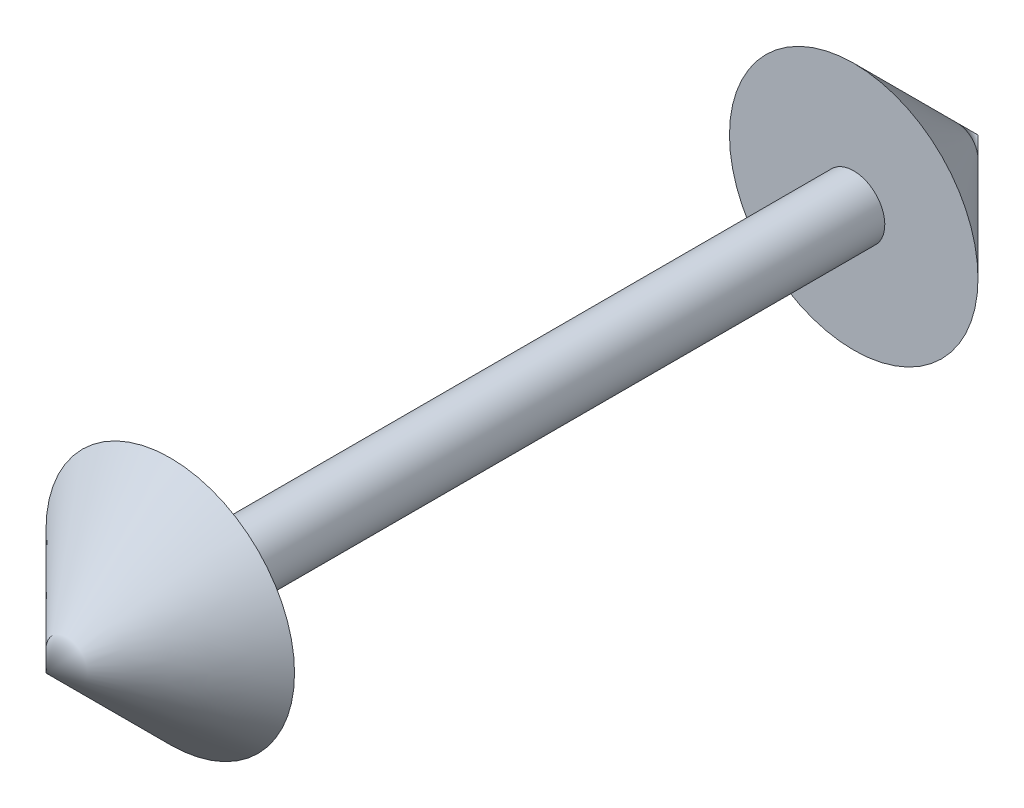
from build123d import *

# Parameters (mm, degrees)
ESQUISSE1_R      = 10
EXTRUSION1_DEPTH = 110


with BuildPart() as part:
    # Esquisse1 → Extrusion1 (new body)
    with BuildSketch(Plane.XY):
        Circle(ESQUISSE1_R)
    extrusion1 = extrude(amount=EXTRUSION1_DEPTH)

    # Esquisse14 → R_volution1 (revolve)
    with BuildSketch(Plane(origin=(0, 0, 0), x_dir=(0, 0, -1), z_dir=(1, 0, 0)), mode=Mode.PRIVATE) as r_volution1_sk:
        Polygon((0, 0), (0, 40), (40, 0), align=None)
    r_volution1 = revolve(r_volution1_sk.sketch.rotate(Axis((0, 0, -40), (0, 0, 1)), 180), axis=Axis((0, 0, -40), (0, 0, 1)))

    # Sym_trie1: Extrusion1, R_volution1 across plane
    add(extrusion1.mirror(Plane.XY.offset(110)))
    add(r_volution1.mirror(Plane.XY.offset(110)))


solid = part.part
